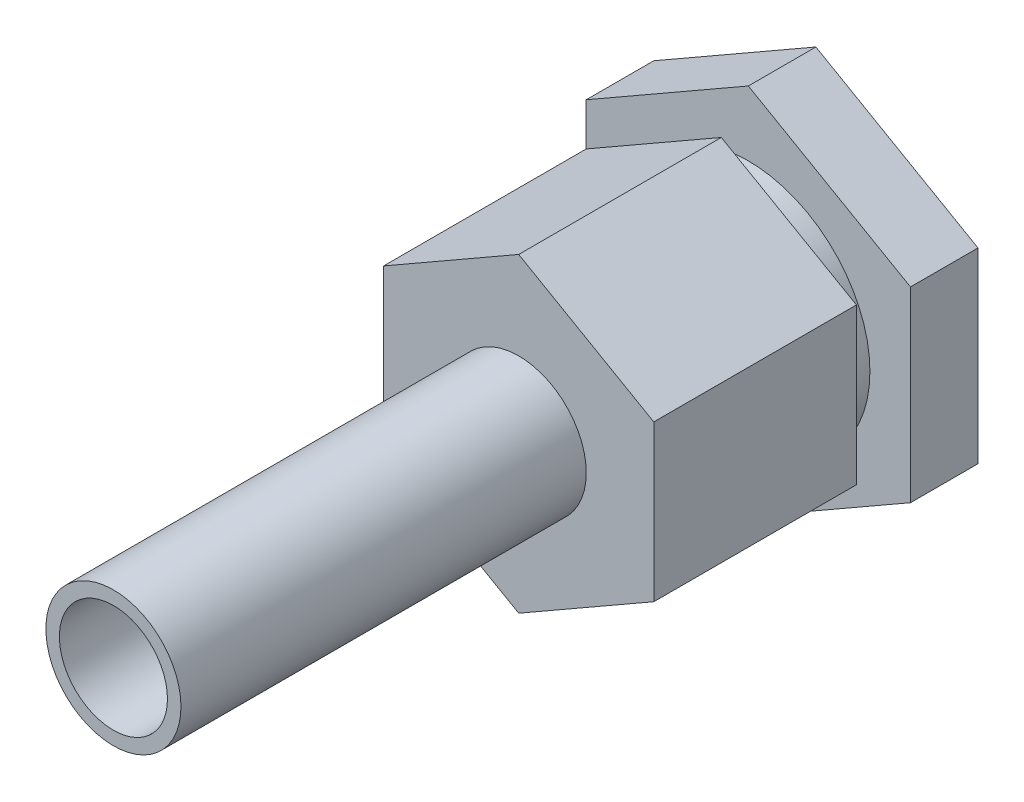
ISO-10303-21;
HEADER;
FILE_DESCRIPTION(('STEP AP214'),'2;1');
FILE_NAME('part.step','',(''),(''),'','','');
FILE_SCHEMA(('AUTOMOTIVE_DESIGN { 1 0 10303 214 1 1 1 1 }'));
ENDSEC;
DATA;
#1=APPLICATION_CONTEXT('core data for automotive mechanical design processes');
#2=APPLICATION_PROTOCOL_DEFINITION('international standard','automotive_design',2000,#1);
#3=PRODUCT_CONTEXT('',#1,'mechanical');
#4=PRODUCT('Part','Part','',(#3));
#5=PRODUCT_RELATED_PRODUCT_CATEGORY('part','',(#4));
#6=PRODUCT_DEFINITION_FORMATION('','',#4);
#7=PRODUCT_DEFINITION_CONTEXT('part definition',#1,'design');
#8=PRODUCT_DEFINITION('design','',#6,#7);
#9=PRODUCT_DEFINITION_SHAPE('','',#8);
#10=(LENGTH_UNIT() NAMED_UNIT(*) SI_UNIT(.MILLI.,.METRE.));
#11=(NAMED_UNIT(*) PLANE_ANGLE_UNIT() SI_UNIT($,.RADIAN.));
#12=(NAMED_UNIT(*) SI_UNIT($,.STERADIAN.) SOLID_ANGLE_UNIT());
#13=UNCERTAINTY_MEASURE_WITH_UNIT(LENGTH_MEASURE(1.E-05),#10,'distance_accuracy_value','');
#14=(GEOMETRIC_REPRESENTATION_CONTEXT(3) GLOBAL_UNCERTAINTY_ASSIGNED_CONTEXT((#13)) GLOBAL_UNIT_ASSIGNED_CONTEXT((#10,
#11,#12)) REPRESENTATION_CONTEXT('',''));
#15=CARTESIAN_POINT('',(0.,0.,0.));
#16=DIRECTION('',(0.,0.,1.));
#17=DIRECTION('',(1.,0.,0.));
#18=AXIS2_PLACEMENT_3D('',#15,#16,#17);
#19=CARTESIAN_POINT('',(-10.,5.76412003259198,22.));
#20=DIRECTION('',(0.,0.,1.));
#21=DIRECTION('',(1.,0.,0.));
#22=AXIS2_PLACEMENT_3D('',#19,#20,#21);
#23=PLANE('',#22);
#24=DIRECTION('',(-0.867435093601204,-0.497550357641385,0.));
#25=VECTOR('',#24,1.);
#26=CARTESIAN_POINT('',(0.,11.5,22.));
#27=LINE('',#26,#25);
#28=CARTESIAN_POINT('',(0.,11.5,22.));
#29=VERTEX_POINT('',#28);
#30=CARTESIAN_POINT('',(-10.,5.76412003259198,22.));
#31=VERTEX_POINT('',#30);
#32=EDGE_CURVE('E166',#29,#31,#27,.T.);
#33=ORIENTED_EDGE('',*,*,#32,.T.);
#34=DIRECTION('',(0.,-1.,0.));
#35=VECTOR('',#34,1.);
#36=CARTESIAN_POINT('',(-10.,5.76412003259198,22.));
#37=LINE('',#36,#35);
#38=CARTESIAN_POINT('',(-10.,-5.76412003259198,22.));
#39=VERTEX_POINT('',#38);
#40=EDGE_CURVE('E141',#31,#39,#37,.T.);
#41=ORIENTED_EDGE('',*,*,#40,.T.);
#42=DIRECTION('',(0.867435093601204,-0.497550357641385,0.));
#43=VECTOR('',#42,1.);
#44=CARTESIAN_POINT('',(0.,-11.5,22.));
#45=LINE('',#44,#43);
#46=CARTESIAN_POINT('',(0.,-11.5,22.));
#47=VERTEX_POINT('',#46);
#48=EDGE_CURVE('E169',#39,#47,#45,.T.);
#49=ORIENTED_EDGE('',*,*,#48,.T.);
#50=DIRECTION('',(0.867435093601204,0.497550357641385,0.));
#51=VECTOR('',#50,1.);
#52=CARTESIAN_POINT('',(0.,-11.5,22.));
#53=LINE('',#52,#51);
#54=CARTESIAN_POINT('',(10.,-5.76412003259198,22.));
#55=VERTEX_POINT('',#54);
#56=EDGE_CURVE('E171',#47,#55,#53,.T.);
#57=ORIENTED_EDGE('',*,*,#56,.T.);
#58=DIRECTION('',(0.,1.,0.));
#59=VECTOR('',#58,1.);
#60=CARTESIAN_POINT('',(10.,5.76412003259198,22.));
#61=LINE('',#60,#59);
#62=CARTESIAN_POINT('',(10.,5.76412003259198,22.));
#63=VERTEX_POINT('',#62);
#64=EDGE_CURVE('E173',#55,#63,#61,.T.);
#65=ORIENTED_EDGE('',*,*,#64,.T.);
#66=DIRECTION('',(-0.867435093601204,0.497550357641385,0.));
#67=VECTOR('',#66,1.);
#68=CARTESIAN_POINT('',(0.,11.5,22.));
#69=LINE('',#68,#67);
#70=EDGE_CURVE('E175',#63,#29,#69,.T.);
#71=ORIENTED_EDGE('',*,*,#70,.T.);
#72=EDGE_LOOP('',(#33,#41,#49,#57,#65,#71));
#73=FACE_BOUND('',#72,.T.);
#74=CARTESIAN_POINT('',(0.,0.,22.));
#75=DIRECTION('',(0.,0.,1.));
#76=DIRECTION('',(1.,0.,0.));
#77=AXIS2_PLACEMENT_3D('',#74,#75,#76);
#78=CIRCLE('',#77,5.);
#79=CARTESIAN_POINT('',(5.,0.,22.));
#80=VERTEX_POINT('',#79);
#81=EDGE_CURVE('E155',#80,#80,#78,.T.);
#82=ORIENTED_EDGE('',*,*,#81,.F.);
#83=EDGE_LOOP('',(#82));
#84=FACE_BOUND('',#83,.T.);
#85=ADVANCED_FACE('F36',(#73,#84),#23,.T.);
#86=CARTESIAN_POINT('',(-12.,6.91694403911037,5.));
#87=DIRECTION('',(0.,0.,1.));
#88=DIRECTION('',(1.,0.,0.));
#89=AXIS2_PLACEMENT_3D('',#86,#87,#88);
#90=PLANE('',#89);
#91=DIRECTION('',(-0.867435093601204,-0.497550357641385,0.));
#92=VECTOR('',#91,1.);
#93=CARTESIAN_POINT('',(0.,13.8,5.));
#94=LINE('',#93,#92);
#95=CARTESIAN_POINT('',(0.,13.8,5.));
#96=VERTEX_POINT('',#95);
#97=CARTESIAN_POINT('',(-12.,6.91694403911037,5.));
#98=VERTEX_POINT('',#97);
#99=EDGE_CURVE('E209',#96,#98,#94,.T.);
#100=ORIENTED_EDGE('',*,*,#99,.T.);
#101=DIRECTION('',(0.,-1.,0.));
#102=VECTOR('',#101,1.);
#103=CARTESIAN_POINT('',(-12.,6.91694403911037,5.));
#104=LINE('',#103,#102);
#105=CARTESIAN_POINT('',(-12.,-6.91694403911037,5.));
#106=VERTEX_POINT('',#105);
#107=EDGE_CURVE('E211',#98,#106,#104,.T.);
#108=ORIENTED_EDGE('',*,*,#107,.T.);
#109=DIRECTION('',(0.867435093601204,-0.497550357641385,0.));
#110=VECTOR('',#109,1.);
#111=CARTESIAN_POINT('',(0.,-13.8,5.));
#112=LINE('',#111,#110);
#113=CARTESIAN_POINT('',(0.,-13.8,5.));
#114=VERTEX_POINT('',#113);
#115=EDGE_CURVE('E213',#106,#114,#112,.T.);
#116=ORIENTED_EDGE('',*,*,#115,.T.);
#117=DIRECTION('',(0.867435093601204,0.497550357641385,0.));
#118=VECTOR('',#117,1.);
#119=CARTESIAN_POINT('',(0.,-13.8,5.));
#120=LINE('',#119,#118);
#121=CARTESIAN_POINT('',(12.,-6.91694403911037,5.));
#122=VERTEX_POINT('',#121);
#123=EDGE_CURVE('E215',#114,#122,#120,.T.);
#124=ORIENTED_EDGE('',*,*,#123,.T.);
#125=DIRECTION('',(0.,1.,0.));
#126=VECTOR('',#125,1.);
#127=CARTESIAN_POINT('',(12.,6.91694403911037,5.));
#128=LINE('',#127,#126);
#129=CARTESIAN_POINT('',(12.,6.91694403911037,5.));
#130=VERTEX_POINT('',#129);
#131=EDGE_CURVE('E56',#122,#130,#128,.T.);
#132=ORIENTED_EDGE('',*,*,#131,.T.);
#133=DIRECTION('',(-0.867435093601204,0.497550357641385,0.));
#134=VECTOR('',#133,1.);
#135=CARTESIAN_POINT('',(0.,13.8,5.));
#136=LINE('',#135,#134);
#137=EDGE_CURVE('E51',#130,#96,#136,.T.);
#138=ORIENTED_EDGE('',*,*,#137,.T.);
#139=EDGE_LOOP('',(#100,#108,#116,#124,#132,#138));
#140=FACE_BOUND('',#139,.T.);
#141=CARTESIAN_POINT('',(0.,0.,5.));
#142=DIRECTION('',(0.,0.,1.));
#143=DIRECTION('',(1.,0.,0.));
#144=AXIS2_PLACEMENT_3D('',#141,#142,#143);
#145=CIRCLE('',#144,9.);
#146=CARTESIAN_POINT('',(9.,0.,5.));
#147=VERTEX_POINT('',#146);
#148=EDGE_CURVE('E193',#147,#147,#145,.F.);
#149=ORIENTED_EDGE('',*,*,#148,.T.);
#150=EDGE_LOOP('',(#149));
#151=FACE_BOUND('',#150,.T.);
#152=ADVANCED_FACE('F243',(#140,#151),#90,.T.);
#153=CARTESIAN_POINT('',(-12.,6.91694403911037,0.));
#154=DIRECTION('',(0.,0.,1.));
#155=DIRECTION('',(1.,0.,0.));
#156=AXIS2_PLACEMENT_3D('',#153,#154,#155);
#157=PLANE('',#156);
#158=DIRECTION('',(-0.867435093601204,-0.497550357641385,0.));
#159=VECTOR('',#158,1.);
#160=CARTESIAN_POINT('',(0.,13.8,0.));
#161=LINE('',#160,#159);
#162=CARTESIAN_POINT('',(0.,13.8,0.));
#163=VERTEX_POINT('',#162);
#164=CARTESIAN_POINT('',(-12.,6.91694403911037,0.));
#165=VERTEX_POINT('',#164);
#166=EDGE_CURVE('E196',#163,#165,#161,.T.);
#167=ORIENTED_EDGE('',*,*,#166,.F.);
#168=DIRECTION('',(-0.867435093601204,0.497550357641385,0.));
#169=VECTOR('',#168,1.);
#170=CARTESIAN_POINT('',(0.,13.8,0.));
#171=LINE('',#170,#169);
#172=CARTESIAN_POINT('',(12.,6.91694403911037,0.));
#173=VERTEX_POINT('',#172);
#174=EDGE_CURVE('E207',#173,#163,#171,.T.);
#175=ORIENTED_EDGE('',*,*,#174,.F.);
#176=DIRECTION('',(0.,1.,0.));
#177=VECTOR('',#176,1.);
#178=CARTESIAN_POINT('',(12.,6.91694403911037,0.));
#179=LINE('',#178,#177);
#180=CARTESIAN_POINT('',(12.,-6.91694403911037,0.));
#181=VERTEX_POINT('',#180);
#182=EDGE_CURVE('E205',#181,#173,#179,.T.);
#183=ORIENTED_EDGE('',*,*,#182,.F.);
#184=DIRECTION('',(0.867435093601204,0.497550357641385,0.));
#185=VECTOR('',#184,1.);
#186=CARTESIAN_POINT('',(0.,-13.8,0.));
#187=LINE('',#186,#185);
#188=CARTESIAN_POINT('',(0.,-13.8,0.));
#189=VERTEX_POINT('',#188);
#190=EDGE_CURVE('E203',#189,#181,#187,.T.);
#191=ORIENTED_EDGE('',*,*,#190,.F.);
#192=DIRECTION('',(0.867435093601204,-0.497550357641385,0.));
#193=VECTOR('',#192,1.);
#194=CARTESIAN_POINT('',(0.,-13.8,0.));
#195=LINE('',#194,#193);
#196=CARTESIAN_POINT('',(-12.,-6.91694403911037,0.));
#197=VERTEX_POINT('',#196);
#198=EDGE_CURVE('E201',#197,#189,#195,.T.);
#199=ORIENTED_EDGE('',*,*,#198,.F.);
#200=DIRECTION('',(0.,-1.,0.));
#201=VECTOR('',#200,1.);
#202=CARTESIAN_POINT('',(-12.,6.91694403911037,0.));
#203=LINE('',#202,#201);
#204=EDGE_CURVE('E199',#165,#197,#203,.T.);
#205=ORIENTED_EDGE('',*,*,#204,.F.);
#206=EDGE_LOOP('',(#167,#175,#183,#191,#199,#205));
#207=FACE_BOUND('',#206,.T.);
#208=CARTESIAN_POINT('',(0.,0.,0.));
#209=DIRECTION('',(0.,0.,1.));
#210=DIRECTION('',(1.,0.,0.));
#211=AXIS2_PLACEMENT_3D('',#208,#209,#210);
#212=CIRCLE('',#211,9.);
#213=CARTESIAN_POINT('',(9.,0.,0.));
#214=VERTEX_POINT('',#213);
#215=EDGE_CURVE('E44',#214,#214,#212,.F.);
#216=ORIENTED_EDGE('',*,*,#215,.F.);
#217=EDGE_LOOP('',(#216));
#218=FACE_BOUND('',#217,.T.);
#219=ADVANCED_FACE('F241',(#207,#218),#157,.F.);
#220=CARTESIAN_POINT('',(0.,13.8,5.));
#221=DIRECTION('',(0.497550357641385,-0.867435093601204,0.));
#222=DIRECTION('',(0.867435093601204,0.497550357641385,0.));
#223=AXIS2_PLACEMENT_3D('',#220,#221,#222);
#224=PLANE('',#223);
#225=ORIENTED_EDGE('',*,*,#166,.T.);
#226=DIRECTION('',(0.,0.,-1.));
#227=VECTOR('',#226,1.);
#228=CARTESIAN_POINT('',(-12.,6.91694403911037,5.));
#229=LINE('',#228,#227);
#230=EDGE_CURVE('E234',#98,#165,#229,.T.);
#231=ORIENTED_EDGE('',*,*,#230,.F.);
#232=ORIENTED_EDGE('',*,*,#99,.F.);
#233=DIRECTION('',(0.,0.,-1.));
#234=VECTOR('',#233,1.);
#235=CARTESIAN_POINT('',(0.,13.8,5.));
#236=LINE('',#235,#234);
#237=EDGE_CURVE('E219',#96,#163,#236,.T.);
#238=ORIENTED_EDGE('',*,*,#237,.T.);
#239=EDGE_LOOP('',(#225,#231,#232,#238));
#240=FACE_BOUND('',#239,.T.);
#241=ADVANCED_FACE('F38',(#240),#224,.F.);
#242=CARTESIAN_POINT('',(-12.,6.91694403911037,5.));
#243=DIRECTION('',(1.,0.,0.));
#244=DIRECTION('',(0.,0.,-1.));
#245=AXIS2_PLACEMENT_3D('',#242,#243,#244);
#246=PLANE('',#245);
#247=ORIENTED_EDGE('',*,*,#204,.T.);
#248=DIRECTION('',(0.,0.,-1.));
#249=VECTOR('',#248,1.);
#250=CARTESIAN_POINT('',(-12.,-6.91694403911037,5.));
#251=LINE('',#250,#249);
#252=EDGE_CURVE('E231',#106,#197,#251,.T.);
#253=ORIENTED_EDGE('',*,*,#252,.F.);
#254=ORIENTED_EDGE('',*,*,#107,.F.);
#255=ORIENTED_EDGE('',*,*,#230,.T.);
#256=EDGE_LOOP('',(#247,#253,#254,#255));
#257=FACE_BOUND('',#256,.T.);
#258=ADVANCED_FACE('F250',(#257),#246,.F.);
#259=CARTESIAN_POINT('',(0.,-13.8,5.));
#260=DIRECTION('',(0.497550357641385,0.867435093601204,0.));
#261=DIRECTION('',(-0.867435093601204,0.497550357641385,0.));
#262=AXIS2_PLACEMENT_3D('',#259,#260,#261);
#263=PLANE('',#262);
#264=ORIENTED_EDGE('',*,*,#198,.T.);
#265=DIRECTION('',(0.,0.,-1.));
#266=VECTOR('',#265,1.);
#267=CARTESIAN_POINT('',(0.,-13.8,5.));
#268=LINE('',#267,#266);
#269=EDGE_CURVE('E228',#114,#189,#268,.T.);
#270=ORIENTED_EDGE('',*,*,#269,.F.);
#271=ORIENTED_EDGE('',*,*,#115,.F.);
#272=ORIENTED_EDGE('',*,*,#252,.T.);
#273=EDGE_LOOP('',(#264,#270,#271,#272));
#274=FACE_BOUND('',#273,.T.);
#275=ADVANCED_FACE('F436',(#274),#263,.F.);
#276=CARTESIAN_POINT('',(0.,-13.8,5.));
#277=DIRECTION('',(-0.497550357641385,0.867435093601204,0.));
#278=DIRECTION('',(-0.867435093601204,-0.497550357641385,0.));
#279=AXIS2_PLACEMENT_3D('',#276,#277,#278);
#280=PLANE('',#279);
#281=ORIENTED_EDGE('',*,*,#190,.T.);
#282=DIRECTION('',(0.,0.,-1.));
#283=VECTOR('',#282,1.);
#284=CARTESIAN_POINT('',(12.,-6.91694403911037,5.));
#285=LINE('',#284,#283);
#286=EDGE_CURVE('E225',#122,#181,#285,.T.);
#287=ORIENTED_EDGE('',*,*,#286,.F.);
#288=ORIENTED_EDGE('',*,*,#123,.F.);
#289=ORIENTED_EDGE('',*,*,#269,.T.);
#290=EDGE_LOOP('',(#281,#287,#288,#289));
#291=FACE_BOUND('',#290,.T.);
#292=ADVANCED_FACE('F427',(#291),#280,.F.);
#293=CARTESIAN_POINT('',(12.,6.91694403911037,5.));
#294=DIRECTION('',(-1.,0.,0.));
#295=DIRECTION('',(0.,0.,1.));
#296=AXIS2_PLACEMENT_3D('',#293,#294,#295);
#297=PLANE('',#296);
#298=ORIENTED_EDGE('',*,*,#182,.T.);
#299=DIRECTION('',(0.,0.,-1.));
#300=VECTOR('',#299,1.);
#301=CARTESIAN_POINT('',(12.,6.91694403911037,5.));
#302=LINE('',#301,#300);
#303=EDGE_CURVE('E222',#130,#173,#302,.T.);
#304=ORIENTED_EDGE('',*,*,#303,.F.);
#305=ORIENTED_EDGE('',*,*,#131,.F.);
#306=ORIENTED_EDGE('',*,*,#286,.T.);
#307=EDGE_LOOP('',(#298,#304,#305,#306));
#308=FACE_BOUND('',#307,.T.);
#309=ADVANCED_FACE('F418',(#308),#297,.F.);
#310=CARTESIAN_POINT('',(0.,13.8,5.));
#311=DIRECTION('',(-0.497550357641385,-0.867435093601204,0.));
#312=DIRECTION('',(0.867435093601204,-0.497550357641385,0.));
#313=AXIS2_PLACEMENT_3D('',#310,#311,#312);
#314=PLANE('',#313);
#315=ORIENTED_EDGE('',*,*,#174,.T.);
#316=ORIENTED_EDGE('',*,*,#237,.F.);
#317=ORIENTED_EDGE('',*,*,#137,.F.);
#318=ORIENTED_EDGE('',*,*,#303,.T.);
#319=EDGE_LOOP('',(#315,#316,#317,#318));
#320=FACE_BOUND('',#319,.T.);
#321=ADVANCED_FACE('F303',(#320),#314,.F.);
#322=CARTESIAN_POINT('',(0.,0.,-2.));
#323=DIRECTION('',(0.,0.,1.));
#324=DIRECTION('',(1.,0.,0.));
#325=AXIS2_PLACEMENT_3D('',#322,#323,#324);
#326=PLANE('',#325);
#327=CARTESIAN_POINT('',(0.,0.,-2.));
#328=DIRECTION('',(0.,0.,1.));
#329=DIRECTION('',(1.,0.,0.));
#330=AXIS2_PLACEMENT_3D('',#327,#328,#329);
#331=CIRCLE('',#330,9.);
#332=CARTESIAN_POINT('',(9.,0.,-2.));
#333=VERTEX_POINT('',#332);
#334=EDGE_CURVE('E145',#333,#333,#331,.T.);
#335=ORIENTED_EDGE('',*,*,#334,.F.);
#336=EDGE_LOOP('',(#335));
#337=FACE_BOUND('',#336,.T.);
#338=ADVANCED_FACE('F297',(#337),#326,.F.);
#339=CARTESIAN_POINT('',(0.,0.,7.));
#340=DIRECTION('',(0.,0.,-1.));
#341=DIRECTION('',(-1.,0.,0.));
#342=AXIS2_PLACEMENT_3D('',#339,#340,#341);
#343=CYLINDRICAL_SURFACE('',#342,9.);
#344=ORIENTED_EDGE('',*,*,#334,.T.);
#345=EDGE_LOOP('',(#344));
#346=FACE_BOUND('',#345,.T.);
#347=ORIENTED_EDGE('',*,*,#215,.T.);
#348=EDGE_LOOP('',(#347));
#349=FACE_BOUND('',#348,.T.);
#350=ADVANCED_FACE('F239',(#346,#349),#343,.T.);
#351=ORIENTED_EDGE('',*,*,#148,.F.);
#352=EDGE_LOOP('',(#351));
#353=FACE_BOUND('',#352,.T.);
#354=CARTESIAN_POINT('',(0.,0.,7.));
#355=DIRECTION('',(0.,0.,1.));
#356=DIRECTION('',(1.,0.,0.));
#357=AXIS2_PLACEMENT_3D('',#354,#355,#356);
#358=CIRCLE('',#357,9.);
#359=CARTESIAN_POINT('',(9.,0.,7.));
#360=VERTEX_POINT('',#359);
#361=EDGE_CURVE('E190',#360,#360,#358,.T.);
#362=ORIENTED_EDGE('',*,*,#361,.F.);
#363=EDGE_LOOP('',(#362));
#364=FACE_BOUND('',#363,.T.);
#365=ADVANCED_FACE('F287',(#353,#364),#343,.T.);
#366=CARTESIAN_POINT('',(-10.,5.76412003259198,7.));
#367=DIRECTION('',(0.,0.,1.));
#368=DIRECTION('',(1.,0.,0.));
#369=AXIS2_PLACEMENT_3D('',#366,#367,#368);
#370=PLANE('',#369);
#371=DIRECTION('',(-0.867435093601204,-0.497550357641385,0.));
#372=VECTOR('',#371,1.);
#373=CARTESIAN_POINT('',(0.,11.5,7.));
#374=LINE('',#373,#372);
#375=CARTESIAN_POINT('',(0.,11.5,7.));
#376=VERTEX_POINT('',#375);
#377=CARTESIAN_POINT('',(-10.,5.76412003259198,7.));
#378=VERTEX_POINT('',#377);
#379=EDGE_CURVE('E131',#376,#378,#374,.T.);
#380=ORIENTED_EDGE('',*,*,#379,.F.);
#381=DIRECTION('',(-0.867435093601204,0.497550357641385,0.));
#382=VECTOR('',#381,1.);
#383=CARTESIAN_POINT('',(0.,11.5,7.));
#384=LINE('',#383,#382);
#385=CARTESIAN_POINT('',(10.,5.76412003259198,7.));
#386=VERTEX_POINT('',#385);
#387=EDGE_CURVE('E164',#386,#376,#384,.T.);
#388=ORIENTED_EDGE('',*,*,#387,.F.);
#389=DIRECTION('',(0.,1.,0.));
#390=VECTOR('',#389,1.);
#391=CARTESIAN_POINT('',(10.,5.76412003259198,7.));
#392=LINE('',#391,#390);
#393=CARTESIAN_POINT('',(10.,-5.76412003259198,7.));
#394=VERTEX_POINT('',#393);
#395=EDGE_CURVE('E162',#394,#386,#392,.T.);
#396=ORIENTED_EDGE('',*,*,#395,.F.);
#397=DIRECTION('',(0.867435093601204,0.497550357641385,0.));
#398=VECTOR('',#397,1.);
#399=CARTESIAN_POINT('',(0.,-11.5,7.));
#400=LINE('',#399,#398);
#401=CARTESIAN_POINT('',(0.,-11.5,7.));
#402=VERTEX_POINT('',#401);
#403=EDGE_CURVE('E160',#402,#394,#400,.T.);
#404=ORIENTED_EDGE('',*,*,#403,.F.);
#405=DIRECTION('',(0.867435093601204,-0.497550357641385,0.));
#406=VECTOR('',#405,1.);
#407=CARTESIAN_POINT('',(0.,-11.5,7.));
#408=LINE('',#407,#406);
#409=CARTESIAN_POINT('',(-10.,-5.76412003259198,7.));
#410=VERTEX_POINT('',#409);
#411=EDGE_CURVE('E133',#410,#402,#408,.T.);
#412=ORIENTED_EDGE('',*,*,#411,.F.);
#413=DIRECTION('',(0.,-1.,0.));
#414=VECTOR('',#413,1.);
#415=CARTESIAN_POINT('',(-10.,5.76412003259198,7.));
#416=LINE('',#415,#414);
#417=EDGE_CURVE('E125',#378,#410,#416,.T.);
#418=ORIENTED_EDGE('',*,*,#417,.F.);
#419=EDGE_LOOP('',(#380,#388,#396,#404,#412,#418));
#420=FACE_BOUND('',#419,.T.);
#421=ORIENTED_EDGE('',*,*,#361,.T.);
#422=EDGE_LOOP('',(#421));
#423=FACE_BOUND('',#422,.T.);
#424=ADVANCED_FACE('F127',(#420,#423),#370,.F.);
#425=CARTESIAN_POINT('',(0.,11.5,22.));
#426=DIRECTION('',(0.497550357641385,-0.867435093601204,0.));
#427=DIRECTION('',(0.867435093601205,0.497550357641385,0.));
#428=AXIS2_PLACEMENT_3D('',#425,#426,#427);
#429=PLANE('',#428);
#430=ORIENTED_EDGE('',*,*,#379,.T.);
#431=DIRECTION('',(0.,0.,-1.));
#432=VECTOR('',#431,1.);
#433=CARTESIAN_POINT('',(-10.,5.76412003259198,22.));
#434=LINE('',#433,#432);
#435=EDGE_CURVE('E139',#31,#378,#434,.T.);
#436=ORIENTED_EDGE('',*,*,#435,.F.);
#437=ORIENTED_EDGE('',*,*,#32,.F.);
#438=DIRECTION('',(0.,0.,-1.));
#439=VECTOR('',#438,1.);
#440=CARTESIAN_POINT('',(0.,11.5,22.));
#441=LINE('',#440,#439);
#442=EDGE_CURVE('E151',#29,#376,#441,.T.);
#443=ORIENTED_EDGE('',*,*,#442,.T.);
#444=EDGE_LOOP('',(#430,#436,#437,#443));
#445=FACE_BOUND('',#444,.T.);
#446=ADVANCED_FACE('F149',(#445),#429,.F.);
#447=CARTESIAN_POINT('',(-10.,5.76412003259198,22.));
#448=DIRECTION('',(1.,0.,0.));
#449=DIRECTION('',(0.,0.,-1.));
#450=AXIS2_PLACEMENT_3D('',#447,#448,#449);
#451=PLANE('',#450);
#452=ORIENTED_EDGE('',*,*,#417,.T.);
#453=DIRECTION('',(0.,0.,-1.));
#454=VECTOR('',#453,1.);
#455=CARTESIAN_POINT('',(-10.,-5.76412003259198,22.));
#456=LINE('',#455,#454);
#457=EDGE_CURVE('E146',#39,#410,#456,.T.);
#458=ORIENTED_EDGE('',*,*,#457,.F.);
#459=ORIENTED_EDGE('',*,*,#40,.F.);
#460=ORIENTED_EDGE('',*,*,#435,.T.);
#461=EDGE_LOOP('',(#452,#458,#459,#460));
#462=FACE_BOUND('',#461,.T.);
#463=ADVANCED_FACE('F140',(#462),#451,.F.);
#464=CARTESIAN_POINT('',(0.,-11.5,22.));
#465=DIRECTION('',(0.497550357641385,0.867435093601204,0.));
#466=DIRECTION('',(-0.867435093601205,0.497550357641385,0.));
#467=AXIS2_PLACEMENT_3D('',#464,#465,#466);
#468=PLANE('',#467);
#469=ORIENTED_EDGE('',*,*,#411,.T.);
#470=DIRECTION('',(0.,0.,-1.));
#471=VECTOR('',#470,1.);
#472=CARTESIAN_POINT('',(0.,-11.5,22.));
#473=LINE('',#472,#471);
#474=EDGE_CURVE('E184',#47,#402,#473,.T.);
#475=ORIENTED_EDGE('',*,*,#474,.F.);
#476=ORIENTED_EDGE('',*,*,#48,.F.);
#477=ORIENTED_EDGE('',*,*,#457,.T.);
#478=EDGE_LOOP('',(#469,#475,#476,#477));
#479=FACE_BOUND('',#478,.T.);
#480=ADVANCED_FACE('F308',(#479),#468,.F.);
#481=CARTESIAN_POINT('',(0.,-11.5,22.));
#482=DIRECTION('',(-0.497550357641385,0.867435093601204,0.));
#483=DIRECTION('',(-0.867435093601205,-0.497550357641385,0.));
#484=AXIS2_PLACEMENT_3D('',#481,#482,#483);
#485=PLANE('',#484);
#486=ORIENTED_EDGE('',*,*,#403,.T.);
#487=DIRECTION('',(0.,0.,-1.));
#488=VECTOR('',#487,1.);
#489=CARTESIAN_POINT('',(10.,-5.76412003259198,22.));
#490=LINE('',#489,#488);
#491=EDGE_CURVE('E181',#55,#394,#490,.T.);
#492=ORIENTED_EDGE('',*,*,#491,.F.);
#493=ORIENTED_EDGE('',*,*,#56,.F.);
#494=ORIENTED_EDGE('',*,*,#474,.T.);
#495=EDGE_LOOP('',(#486,#492,#493,#494));
#496=FACE_BOUND('',#495,.T.);
#497=ADVANCED_FACE('F311',(#496),#485,.F.);
#498=CARTESIAN_POINT('',(10.,5.76412003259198,22.));
#499=DIRECTION('',(-1.,0.,0.));
#500=DIRECTION('',(0.,0.,1.));
#501=AXIS2_PLACEMENT_3D('',#498,#499,#500);
#502=PLANE('',#501);
#503=ORIENTED_EDGE('',*,*,#395,.T.);
#504=DIRECTION('',(0.,0.,-1.));
#505=VECTOR('',#504,1.);
#506=CARTESIAN_POINT('',(10.,5.76412003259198,22.));
#507=LINE('',#506,#505);
#508=EDGE_CURVE('E178',#63,#386,#507,.T.);
#509=ORIENTED_EDGE('',*,*,#508,.F.);
#510=ORIENTED_EDGE('',*,*,#64,.F.);
#511=ORIENTED_EDGE('',*,*,#491,.T.);
#512=EDGE_LOOP('',(#503,#509,#510,#511));
#513=FACE_BOUND('',#512,.T.);
#514=ADVANCED_FACE('F315',(#513),#502,.F.);
#515=CARTESIAN_POINT('',(0.,11.5,22.));
#516=DIRECTION('',(-0.497550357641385,-0.867435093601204,0.));
#517=DIRECTION('',(0.867435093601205,-0.497550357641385,0.));
#518=AXIS2_PLACEMENT_3D('',#515,#516,#517);
#519=PLANE('',#518);
#520=ORIENTED_EDGE('',*,*,#387,.T.);
#521=ORIENTED_EDGE('',*,*,#442,.F.);
#522=ORIENTED_EDGE('',*,*,#70,.F.);
#523=ORIENTED_EDGE('',*,*,#508,.T.);
#524=EDGE_LOOP('',(#520,#521,#522,#523));
#525=FACE_BOUND('',#524,.T.);
#526=ADVANCED_FACE('F284',(#525),#519,.F.);
#527=CARTESIAN_POINT('',(0.,0.,52.));
#528=DIRECTION('',(0.,0.,1.));
#529=DIRECTION('',(1.,0.,0.));
#530=AXIS2_PLACEMENT_3D('',#527,#528,#529);
#531=PLANE('',#530);
#532=CARTESIAN_POINT('',(0.,0.,52.));
#533=DIRECTION('',(0.,0.,1.));
#534=DIRECTION('',(1.,0.,0.));
#535=AXIS2_PLACEMENT_3D('',#532,#533,#534);
#536=CIRCLE('',#535,5.);
#537=CARTESIAN_POINT('',(5.,0.,52.));
#538=VERTEX_POINT('',#537);
#539=EDGE_CURVE('E152',#538,#538,#536,.T.);
#540=ORIENTED_EDGE('',*,*,#539,.T.);
#541=EDGE_LOOP('',(#540));
#542=FACE_BOUND('',#541,.T.);
#543=CARTESIAN_POINT('',(0.,0.,52.));
#544=DIRECTION('',(0.,0.,1.));
#545=DIRECTION('',(1.,0.,0.));
#546=AXIS2_PLACEMENT_3D('',#543,#544,#545);
#547=CIRCLE('',#546,4.);
#548=CARTESIAN_POINT('',(4.,0.,52.));
#549=VERTEX_POINT('',#548);
#550=EDGE_CURVE('E489',#549,#549,#547,.T.);
#551=ORIENTED_EDGE('',*,*,#550,.F.);
#552=EDGE_LOOP('',(#551));
#553=FACE_BOUND('',#552,.T.);
#554=ADVANCED_FACE('F278',(#542,#553),#531,.T.);
#555=CARTESIAN_POINT('',(0.,0.,52.));
#556=DIRECTION('',(0.,0.,-1.));
#557=DIRECTION('',(-1.,0.,0.));
#558=AXIS2_PLACEMENT_3D('',#555,#556,#557);
#559=CYLINDRICAL_SURFACE('',#558,5.);
#560=ORIENTED_EDGE('',*,*,#539,.F.);
#561=EDGE_LOOP('',(#560));
#562=FACE_BOUND('',#561,.T.);
#563=ORIENTED_EDGE('',*,*,#81,.T.);
#564=EDGE_LOOP('',(#563));
#565=FACE_BOUND('',#564,.T.);
#566=ADVANCED_FACE('F270',(#562,#565),#559,.T.);
#567=CARTESIAN_POINT('',(0.,0.,52.));
#568=DIRECTION('',(0.,0.,-1.));
#569=DIRECTION('',(-1.,0.,0.));
#570=AXIS2_PLACEMENT_3D('',#567,#568,#569);
#571=CYLINDRICAL_SURFACE('',#570,4.);
#572=ORIENTED_EDGE('',*,*,#550,.T.);
#573=EDGE_LOOP('',(#572));
#574=FACE_BOUND('',#573,.T.);
#575=CARTESIAN_POINT('',(0.,0.,22.));
#576=DIRECTION('',(0.,0.,1.));
#577=DIRECTION('',(1.,0.,0.));
#578=AXIS2_PLACEMENT_3D('',#575,#576,#577);
#579=CIRCLE('',#578,4.);
#580=CARTESIAN_POINT('',(4.,0.,22.));
#581=VERTEX_POINT('',#580);
#582=EDGE_CURVE('E12',#581,#581,#579,.F.);
#583=ORIENTED_EDGE('',*,*,#582,.T.);
#584=EDGE_LOOP('',(#583));
#585=FACE_BOUND('',#584,.T.);
#586=ADVANCED_FACE('F265',(#574,#585),#571,.F.);
#587=ORIENTED_EDGE('',*,*,#582,.F.);
#588=EDGE_LOOP('',(#587));
#589=FACE_BOUND('',#588,.T.);
#590=ADVANCED_FACE('F258',(#589),#23,.T.);
#591=CLOSED_SHELL('',(#85,#152,#219,#241,#258,#275,#292,#309,#321,#338,#350,#365,#424,#446,#463,
#480,#497,#514,#526,#554,#566,#586,#590));
#592=MANIFOLD_SOLID_BREP('B2',#591);
#593=ADVANCED_BREP_SHAPE_REPRESENTATION('',(#18,#592),#14);
#594=SHAPE_DEFINITION_REPRESENTATION(#9,#593);
ENDSEC;
END-ISO-10303-21;
